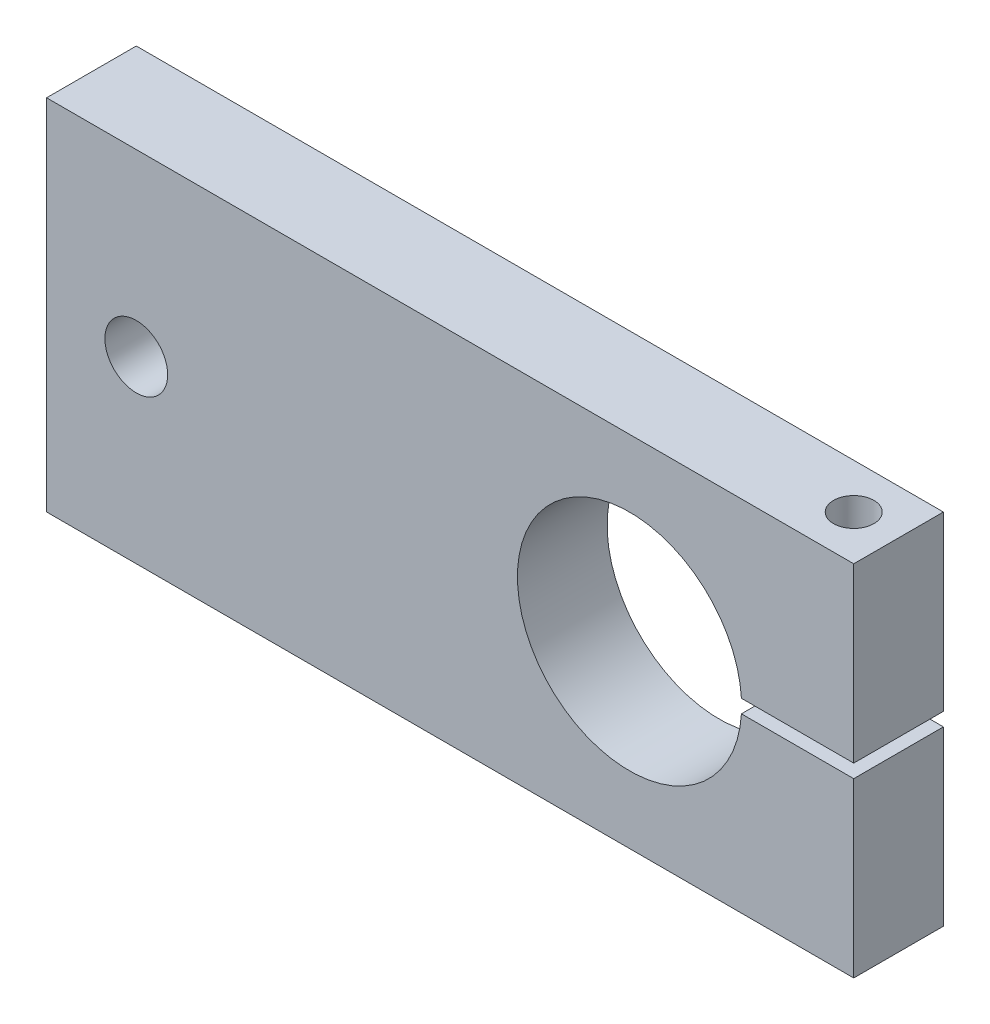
from build123d import *

# Parameters (mm, degrees)
SKETCH_1_R          = 7
EXTRUDE_2_DEPTH     = 20
SKETCH_2_R          = 7
CUT_EXTRUDE_1_DEPTH = 10
SKETCH_3_R          = 4.5
CUT_EXTRUDE_2_DEPTH = 78


with BuildPart() as part:
    # Sketch 1 → Extrude 2 (new body)
    with BuildSketch(Plane.XY):
        with BuildLine():
            Line((-130, 40), (-130, -40))
            Line((-130, -40), (50, -40))
            Line((50, -40), (50, -1.5))
            Line((50, -1.5), (24.954959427, -1.5))
            ThreePointArc((24.954959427, -1.5), (-25, 0), (24.954959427, 1.5))
            Line((24.954959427, 1.5), (50, 1.5))
            Line((50, 1.5), (50, 40))
            Line((50, 40), (-130, 40))
        make_face()
        with Locations((-110, 0)):
            Circle(SKETCH_1_R, mode=Mode.SUBTRACT)
    extrude(amount=EXTRUDE_2_DEPTH)

    # Sketch 2 → Cut-Extrude 1 (cut)
    with BuildSketch(Plane.XZ.offset(40)):
        with Locations(Location((40, 10, 0), (0, 0, 270))):
            Circle(SKETCH_2_R)
    extrude(amount=-CUT_EXTRUDE_1_DEPTH, mode=Mode.SUBTRACT)

    # Sketch 3 → Cut-Extrude 2 (cut)
    with BuildSketch(Plane.XZ.offset(30)):
        with Locations(Location((40, 10, 0), (0, 0, 270))):
            Circle(SKETCH_3_R)
    extrude(amount=-CUT_EXTRUDE_2_DEPTH, mode=Mode.SUBTRACT)


solid = part.part
